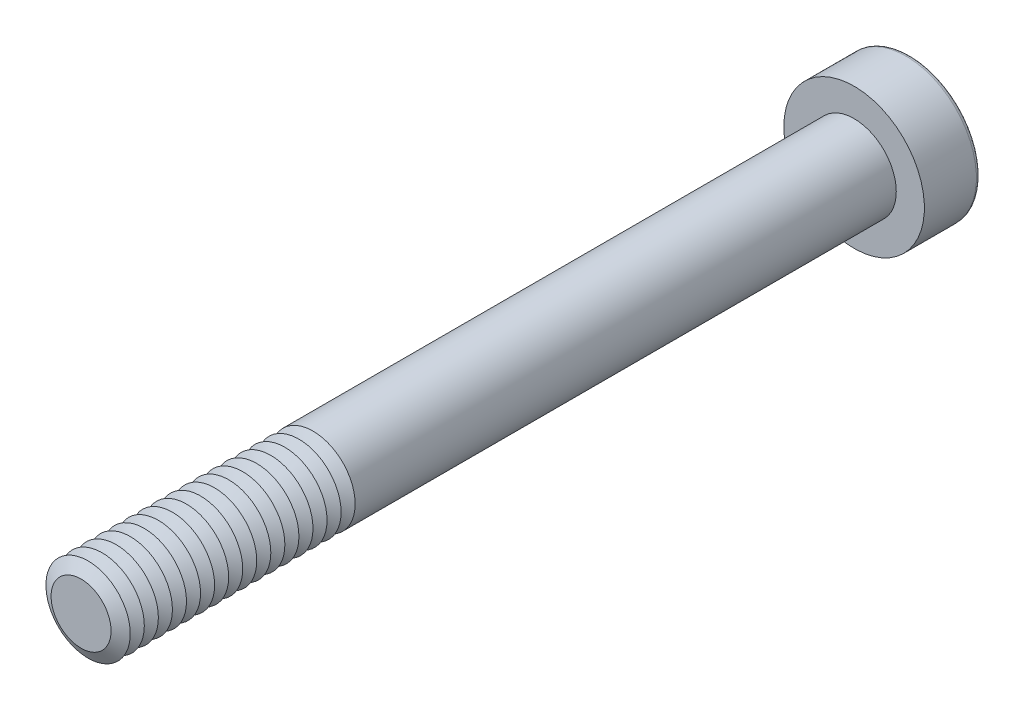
from build123d import *

# Parameters (mm, degrees)
SKETCH1_R           = 3
BOSS_EXTRUDE1_DEPTH = 55
SKETCH2_R           = 5
BOSS_EXTRUDE2_DEPTH = 4
CUT_EXTRUDE1_DEPTH  = 3
FILLET1_R           = 0.3
LPATTERN1_COUNT     = 17
LPATTERN1_PITCH     = 1


with BuildPart() as part:
    # Sketch1 → Boss-Extrude1 (new body)
    with BuildSketch(Plane.XY):
        Circle(SKETCH1_R)
    extrude(amount=BOSS_EXTRUDE1_DEPTH)

    # Sketch2 → Boss-Extrude2 (add)
    with BuildSketch(Plane(origin=(0, 0, 0), x_dir=(-1, 0, 0), z_dir=(0, 0, -1))):
        Circle(SKETCH2_R)
    extrude(amount=BOSS_EXTRUDE2_DEPTH)

    # Sketch3 → Cut-Extrude1 (cut)
    with BuildSketch(Plane(origin=(0, 0, -4), x_dir=(-1, 0, 0), z_dir=(0, 0, -1))):
        Polygon((-1.154700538, 2), (-2.309401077, 0), (-1.154700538, -2), (1.154700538, -2), (2.309401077, 0), (1.154700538, 2), align=None)
    extrude(amount=-CUT_EXTRUDE1_DEPTH, mode=Mode.SUBTRACT)

    # Fillet1
    fillet1_edges = [part.edges().sort_by_distance(p)[0] for p in [
        (5, 0, -4),
    ]]
    fillet(fillet1_edges, radius=FILLET1_R)

    # Cut-Extrude2 cone 1 section (on through the dimple's axis) → Cut-Extrude2 (revolve, cut)
    with BuildSketch(Plane(origin=(0, 0, -1), x_dir=(0, 1, 0), z_dir=(1, 0, 0))):
        Polygon((0, 0), (2, 0), (0, 1.154700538), align=None)
    revolve(axis=Axis((0, 0, -1), (0, 0, 1)), mode=Mode.SUBTRACT)

    # Cut-Extrude3 cone 1 section (on through the dimple's axis) → Cut-Extrude3 (revolve, cut)
    with BuildSketch(Plane(origin=(0, 0, -4), x_dir=(0, 1, 0), z_dir=(1, 0, 0))):
        Polygon((0, 0), (2.309401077, 0), (0, 0.618802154), align=None)
    revolve(axis=Axis((0, 0, -4), (0, 0, 1)), mode=Mode.SUBTRACT)

    # Sketch7 → Cut-Revolve1 (revolve, cut)
    with BuildSketch(Plane(origin=(0, 0, 0), x_dir=(0, 0, -1), z_dir=(1, 0, 0)), mode=Mode.PRIVATE) as cut_revolve1_sk:
        Polygon((-55, 2.133974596), (-54.5, 3), (-55.5, 3), align=None)
    cut_revolve1 = revolve(cut_revolve1_sk.sketch.rotate(Axis((0, 0, 55), (0, 0, -1)), 90), axis=Axis((0, 0, 55), (0, 0, -1)), mode=Mode.SUBTRACT)

    # LPattern1: Cut-Revolve1 ×17
    with Locations(*[(0, 0, -i * LPATTERN1_PITCH) for i in range(1, LPATTERN1_COUNT)]):
        add(cut_revolve1, mode=Mode.SUBTRACT)


solid = part.part
